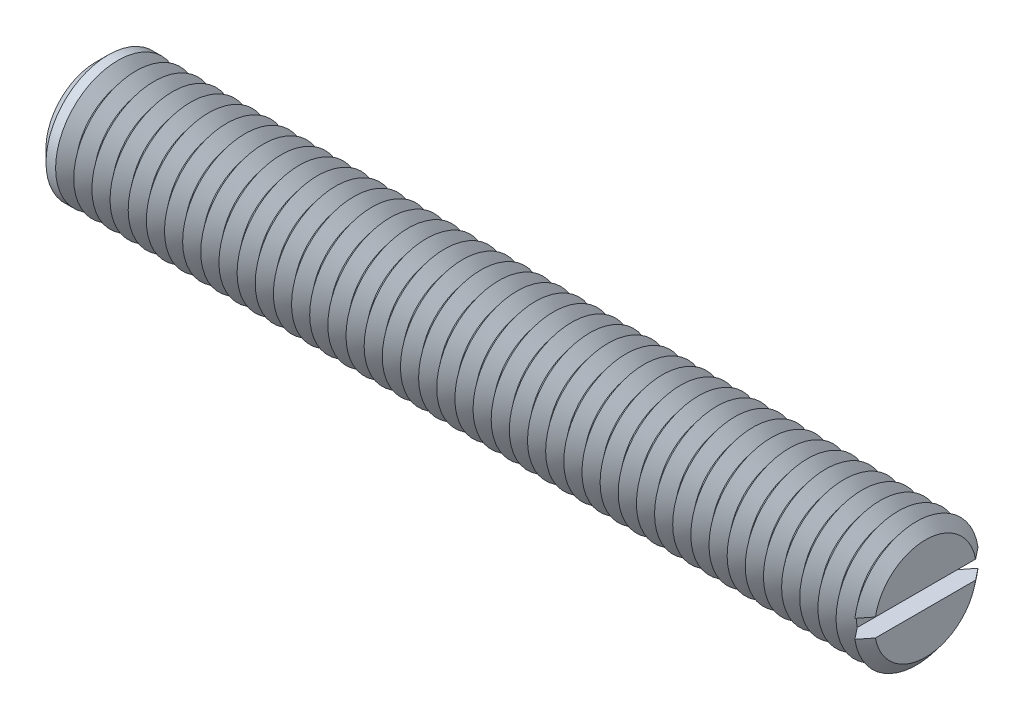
from build123d import *

# Parameters (mm, degrees)
SKETCH1_R       = 6
EXTRUDE1_DEPTH  = 40
SKETCH2_W       = 1.75
SKETCH2_H       = 1.75
EXTRUDE2_DEPTH  = 9
CHAMFER1_SIZE   = 1.2
LPATTERN1_COUNT = 45
LPATTERN1_PITCH = 1.75


with BuildPart() as part:
    # Sketch1 → Extrude1 (new, symmetric)
    with BuildSketch(Plane(origin=(0, 0, 0), x_dir=(0, 0, -1), z_dir=(1, 0, 0))):
        Circle(SKETCH1_R)
    extrude(amount=EXTRUDE1_DEPTH, both=True)

    # Sketch2 → Extrude2 (cut, symmetric)
    with BuildSketch(Plane.XY):
        with Locations((39.125, 0)):
            Rectangle(SKETCH2_W, SKETCH2_H)
    extrude(amount=EXTRUDE2_DEPTH, both=True, mode=Mode.SUBTRACT)

    # Chamfer1
    chamfer1_edges = [part.edges().sort_by_distance(p)[0] for p in [
        (-40, 0, 6),
    ]]
    chamfer(chamfer1_edges, length=CHAMFER1_SIZE)

    # Sketch3 → Cut-Revolve1 (revolve, cut)
    with BuildSketch(Plane.XY, mode=Mode.PRIVATE) as cut_revolve1_sk:
        Polygon((39.125, -6), (40.875, -6), (40, -4.90712535), align=None)
    cut_revolve1 = revolve(cut_revolve1_sk.sketch.rotate(Axis((0, 0, 0), (1, 0, 0)), 261.614461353), axis=Axis((0, 0, 0), (1, 0, 0)), mode=Mode.SUBTRACT)

    # LPattern1: Cut-Revolve1 ×45
    with Locations(*[(-i * LPATTERN1_PITCH, 0, 0) for i in range(1, LPATTERN1_COUNT)]):
        add(cut_revolve1, mode=Mode.SUBTRACT)


solid = part.part
